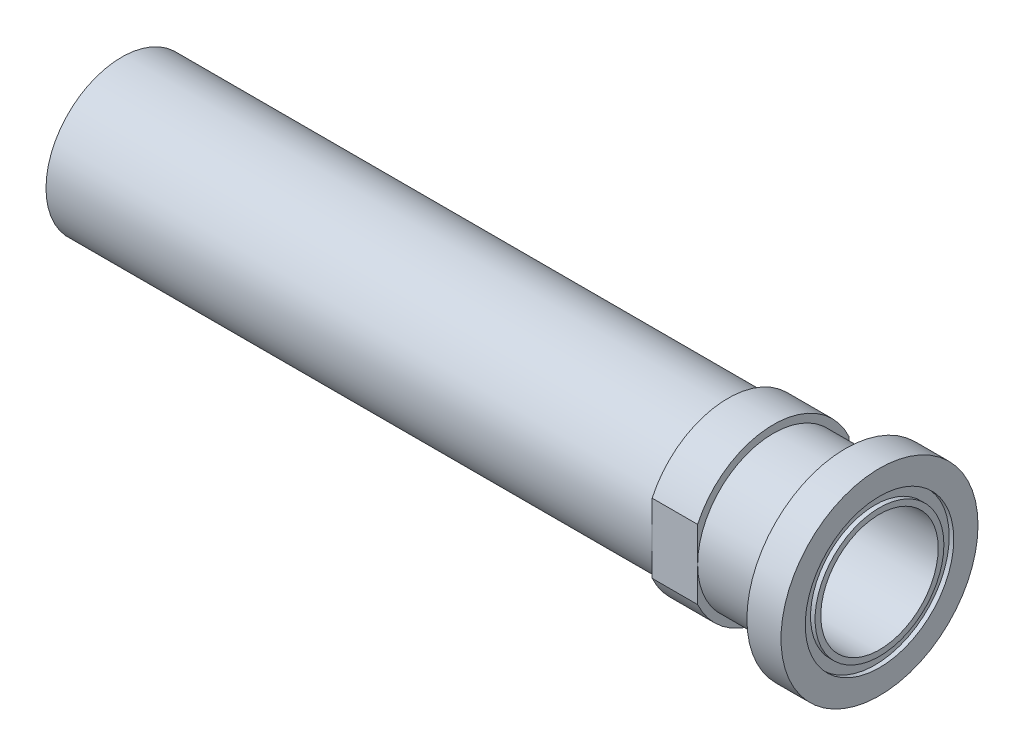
from build123d import *

# Parameters (mm, degrees)
SCHIZZO1_R                   = 130
ESTRUSIONE_ESTRUSIONE1_DEPTH = 1000
TAGLIO_ESTRUSIONE1_START     = -955
SCHIZZO3_R                   = 130
SCHIZZO3_R_2                 = 110
TAGLIO_ESTRUSIONE1_DEPTH     = 955
SCHIZZO16_R                  = 98
SCHIZZO16_R_2                = 85
TAGLIO_ESTRUSIONE4_DEPTH     = 6
TAGLIO_ESTRUSIONE8_START     = -800
SCHIZZO25_R                  = 110
SCHIZZO25_R_2                = 100
TAGLIO_ESTRUSIONE8_DEPTH     = 800
SCHIZZO21_W                  = 95
SCHIZZO21_H                  = 10
TAGLIO_ESTRUSIONE6_DEPTH     = 60
RACCORDO10_R                 = 5
SCHIZZO24_R                  = 77.5
TAGLIO_ESTRUSIONE7_DEPTH     = 900
RACCORDO12_R                 = 15
SCHIZZO29_R                  = 2.5
TAGLIO_ESTRUSIONE9_DEPTH     = 100
SCHIZZO30_R                  = 90
SCHIZZO30_R_2                = 6
TAGLIO_ESTRUSIONE10_DEPTH    = 17
SCHIZZO32_R                  = 6
SCHIZZO32_R_2                = 2.5
TAGLIO_ESTRUSIONE11_DEPTH    = 2
RACCORDO13_R                 = 5
SCHIZZO46_R                  = 6
SCHIZZO46_R_2                = 4.8
TAGLIO_ESTRUSIONE12_DEPTH    = 0.5


with BuildPart() as part:
    # Schizzo1 → Estrusione-Estrusione1 (new body)
    with BuildSketch(Plane(origin=(0, 0, 0), x_dir=(0, 0, -1), z_dir=(1, 0, 0))):
        Circle(SCHIZZO1_R)
    extrude(amount=-ESTRUSIONE_ESTRUSIONE1_DEPTH)

    # Schizzo3 → Taglio-Estrusione1 (cut)
    with BuildSketch(Plane.ZY.offset(1000).offset(TAGLIO_ESTRUSIONE1_START)):
        with Locations(Location((0, 0, 0), (0, 0, 180))):
            Circle(SCHIZZO3_R)
        Circle(SCHIZZO3_R_2, mode=Mode.SUBTRACT)
    extrude(amount=TAGLIO_ESTRUSIONE1_DEPTH, mode=Mode.SUBTRACT)

    # Schizzo16 → Taglio-Estrusione4 (cut)
    with BuildSketch(Plane(origin=(0, 0, 0), x_dir=(0, 0, -1), z_dir=(1, 0, 0))):
        Circle(SCHIZZO16_R)
        Circle(SCHIZZO16_R_2, mode=Mode.SUBTRACT)
    extrude(amount=-TAGLIO_ESTRUSIONE4_DEPTH, mode=Mode.SUBTRACT)

    # Schizzo25 → Taglio-Estrusione8 (cut)
    with BuildSketch(Plane.ZY.offset(1000).offset(TAGLIO_ESTRUSIONE8_START)):
        Circle(SCHIZZO25_R)
        Circle(SCHIZZO25_R_2, mode=Mode.SUBTRACT)
    extrude(amount=TAGLIO_ESTRUSIONE8_DEPTH, mode=Mode.SUBTRACT)

    # Schizzo21 → Taglia-Rivoluzione6 (revolve, cut)
    with BuildSketch(Plane(origin=(0, 0, 0), x_dir=(1, 0, 0), z_dir=(0, 1, 0))):
        with Locations((-92.5, 105)):
            Rectangle(SCHIZZO21_W, SCHIZZO21_H)
    revolve(axis=Axis((56.339771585, 0, 0), (-1, 0, 0)), mode=Mode.SUBTRACT)

    # Schizzo23 → Taglio-Estrusione6 (cut)
    with BuildSketch(Plane(origin=(-140, 0, 0), x_dir=(0, 0, -1), z_dir=(1, 0, 0))):
        with BuildLine():
            Line((-100, -83.066238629), (-100, 83.066238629))
            ThreePointArc((-100, 83.066238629), (-130, 0), (-100, -83.066238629))
        make_face()
        with BuildLine():
            Line((100, -83.066238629), (100, 83.066238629))
            ThreePointArc((100, 83.066238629), (130, 0), (100, -83.066238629))
        make_face()
    extrude(amount=-TAGLIO_ESTRUSIONE6_DEPTH, mode=Mode.SUBTRACT)

    # Raccordo10
    raccordo10_edges = [part.edges().sort_by_distance(p)[0] for p in [
        (-45, 0, 100),
    ]]
    fillet(raccordo10_edges, radius=RACCORDO10_R)

    # Schizzo24 → Taglio-Estrusione7 (cut)
    with BuildSketch(Plane(origin=(0, 0, 0), x_dir=(0, 0, -1), z_dir=(1, 0, 0))):
        Circle(SCHIZZO24_R)
    extrude(amount=-TAGLIO_ESTRUSIONE7_DEPTH, mode=Mode.SUBTRACT)

    # Raccordo12
    raccordo12_edges = [part.edges().sort_by_distance(p)[0] for p in [
        (-900, 0, 77.5),
    ]]
    fillet(raccordo12_edges, radius=RACCORDO12_R)

    # Schizzo29 → Taglio-Estrusione9 (cut)
    with BuildSketch(Plane.ZY.offset(1000)):
        Circle(SCHIZZO29_R)
    extrude(amount=-TAGLIO_ESTRUSIONE9_DEPTH, mode=Mode.SUBTRACT)

    # Schizzo30 → Taglio-Estrusione10 (cut)
    with BuildSketch(Plane.ZY.offset(1000)):
        Circle(SCHIZZO30_R)
        Circle(SCHIZZO30_R_2, mode=Mode.SUBTRACT)
    extrude(amount=-TAGLIO_ESTRUSIONE10_DEPTH, mode=Mode.SUBTRACT)

    # Schizzo32 → Taglio-Estrusione11 (cut)
    with BuildSketch(Plane.ZY.offset(1000)):
        Circle(SCHIZZO32_R)
        Circle(SCHIZZO32_R_2, mode=Mode.SUBTRACT)
    extrude(amount=-TAGLIO_ESTRUSIONE11_DEPTH, mode=Mode.SUBTRACT)

    # Schizzo33 → Taglia-Rivoluzione7 (revolve, cut)
    with BuildSketch(Plane(origin=(0, 0, 0), x_dir=(1, 0, 0), z_dir=(0, 1, 0)), mode=Mode.PRIVATE) as taglia_rivoluzione7_sk:
        Polygon((-998, 4.2), (-994.873893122, 3), (-992, 3), (-992, 0), (-998, 0), align=None)
    revolve(taglia_rivoluzione7_sk.sketch.rotate(Axis((-1000, 0, 0), (1, 0, 0)), 180), axis=Axis((-1000, 0, 0), (1, 0, 0)), mode=Mode.SUBTRACT)

    # Raccordo13
    raccordo13_edges = [part.edges().sort_by_distance(p)[0] for p in [
        (-983, 0, -6),
    ]]
    fillet(raccordo13_edges, radius=RACCORDO13_R)

    # Schizzo46 → Taglio-Estrusione12 (cut)
    with BuildSketch(Plane.ZY.offset(998)):
        Circle(SCHIZZO46_R)
        Circle(SCHIZZO46_R_2, mode=Mode.SUBTRACT)
    extrude(amount=-TAGLIO_ESTRUSIONE12_DEPTH, mode=Mode.SUBTRACT)


solid = part.part
